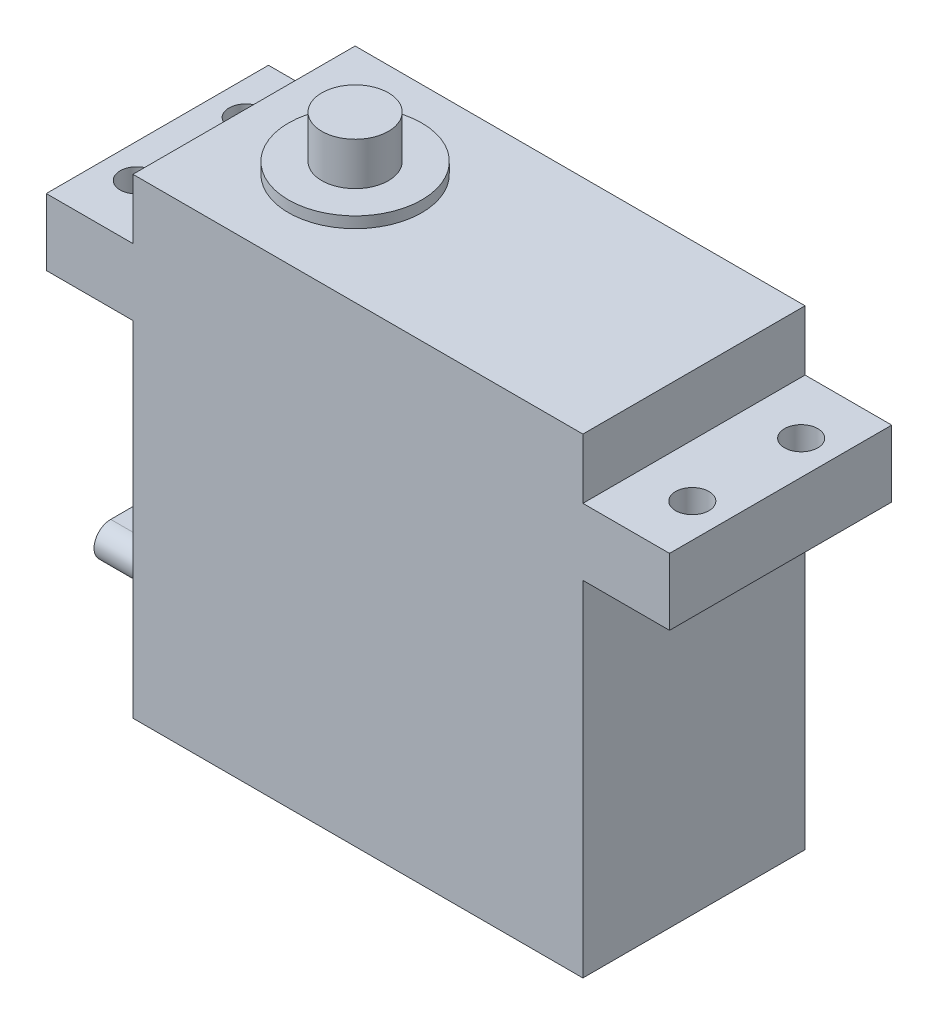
from build123d import *

# Parameters (mm, degrees)
EXTRUSION1_DEPTH        = 20
ESQUISSE2_R             = 1.5
ENL_V_MAT_EXTRU_1_DEPTH = 65.045999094
EXTRUSION5_DEPTH        = 0.5
EXTRUSION6_DEPTH        = 10
ESQUISSE8_R             = 6
BOSS_EXTRU_1_DEPTH      = 1
ESQUISSE9_R             = 3
BOSS_EXTRU_2_DEPTH      = 3.85


with BuildPart() as part:
    # Esquisse1 → Extrusion1 (new body)
    with BuildSketch(Plane.XY):
        Polygon((48.3, 37), (40.5, 37), (40.5, 42.4), (0, 42.4), (0, 37), (-7.8, 37), (-7.8, 31), (0, 31), (0, 0), (40.5, 0), (40.5, 31), (48.3, 31), align=None)
    extrude(amount=EXTRUSION1_DEPTH)

    # Esquisse2 → Enl_v. mat.-Extru.1 (cut, through all)
    with BuildSketch(Plane(origin=(0, 37, 0), x_dir=(1, 0, 0), z_dir=(0, 1, 0))):
        with Locations(Location((-4.75, -5.1, 0), (0, 0, 270))):
            Circle(ESQUISSE2_R)
        with Locations(Location((-4.75, -14.9, 0), (0, 0, 270))):
            Circle(ESQUISSE2_R)
        with Locations(Location((45.25, -14.9, 0), (0, 0, 270))):
            Circle(ESQUISSE2_R)
        with Locations(Location((45.25, -5.1, 0), (0, 0, 270))):
            Circle(ESQUISSE2_R)
    extrude(amount=-ENL_V_MAT_EXTRU_1_DEPTH, mode=Mode.SUBTRACT)

    # Esquisse6 → Extrusion5 (add)
    with BuildSketch(Plane.ZY):
        with BuildLine():
            Line((8.5, 6.5), (11.5, 6.5))
            ThreePointArc((11.5, 6.5), (13.5, 4.5), (11.5, 2.5))
            Line((11.5, 2.5), (8.5, 2.5))
            ThreePointArc((8.5, 2.5), (6.5, 4.5), (8.5, 6.5))
        make_face()
    extrude(amount=EXTRUSION5_DEPTH)

    # Esquisse7 → Extrusion6 (add)
    with BuildSketch(Plane.ZY.offset(0.5)):
        with BuildLine():
            Line((8.5, 3), (11.5, 3))
            ThreePointArc((11.5, 3), (13, 4.5), (11.5, 6))
            Line((11.5, 6), (8.5, 6))
            ThreePointArc((8.5, 6), (7, 4.5), (8.5, 3))
        make_face()
    extrude(amount=EXTRUSION6_DEPTH)

    # Esquisse8 → Boss.-Extru.1 (add)
    with BuildSketch(Plane(origin=(0, 42.4, 0), x_dir=(1, 0, 0), z_dir=(0, 1, 0))):
        with Locations(Location((10, -10, 0), (0, 0, 90))):
            Circle(ESQUISSE8_R)
    extrude(amount=BOSS_EXTRU_1_DEPTH)


with BuildPart() as body_2:
    # Esquisse9 → Boss.-Extru.2 (new body)
    with BuildSketch(Plane(origin=(0, 43.4, 0), x_dir=(1, 0, 0), z_dir=(0, 1, 0))):
        with Locations(Location((10, -10, 0), (0, 0, 90))):
            Circle(ESQUISSE9_R)
    extrude(amount=BOSS_EXTRU_2_DEPTH)


solid = Compound([part.part, body_2.part])
